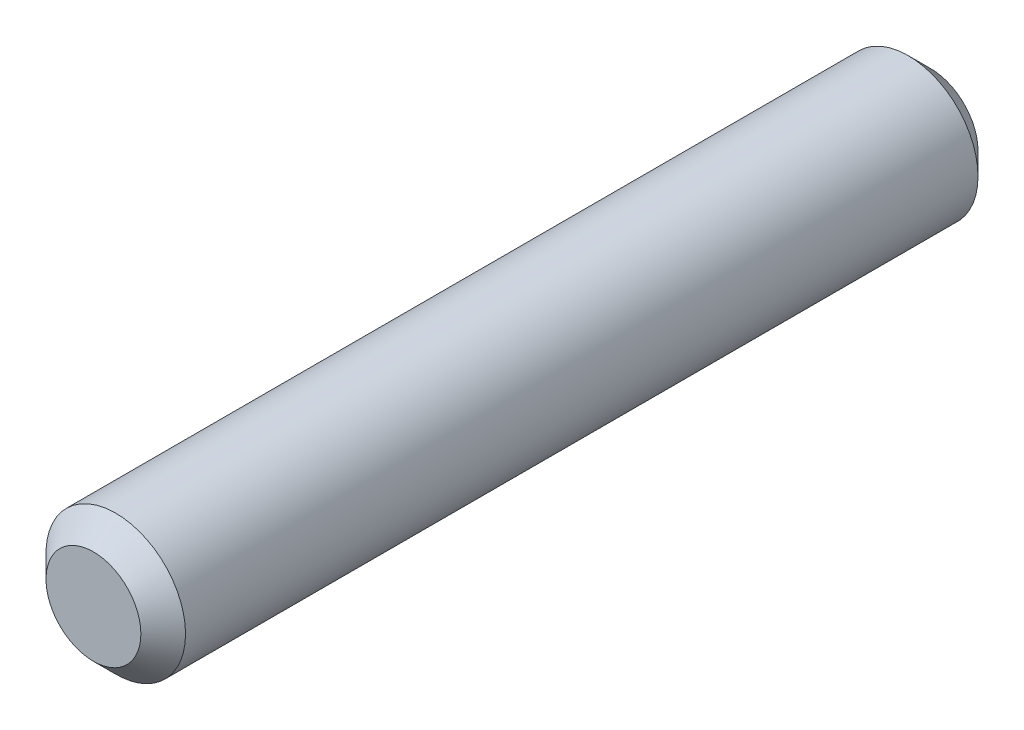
ISO-10303-21;
HEADER;
FILE_DESCRIPTION(('STEP AP214'),'2;1');
FILE_NAME('part.step','',(''),(''),'','','');
FILE_SCHEMA(('AUTOMOTIVE_DESIGN { 1 0 10303 214 1 1 1 1 }'));
ENDSEC;
DATA;
#1=APPLICATION_CONTEXT('core data for automotive mechanical design processes');
#2=APPLICATION_PROTOCOL_DEFINITION('international standard','automotive_design',2000,#1);
#3=PRODUCT_CONTEXT('',#1,'mechanical');
#4=PRODUCT('Part','Part','',(#3));
#5=PRODUCT_RELATED_PRODUCT_CATEGORY('part','',(#4));
#6=PRODUCT_DEFINITION_FORMATION('','',#4);
#7=PRODUCT_DEFINITION_CONTEXT('part definition',#1,'design');
#8=PRODUCT_DEFINITION('design','',#6,#7);
#9=PRODUCT_DEFINITION_SHAPE('','',#8);
#10=(LENGTH_UNIT() NAMED_UNIT(*) SI_UNIT(.MILLI.,.METRE.));
#11=(NAMED_UNIT(*) PLANE_ANGLE_UNIT() SI_UNIT($,.RADIAN.));
#12=(NAMED_UNIT(*) SI_UNIT($,.STERADIAN.) SOLID_ANGLE_UNIT());
#13=UNCERTAINTY_MEASURE_WITH_UNIT(LENGTH_MEASURE(1.E-05),#10,'distance_accuracy_value','');
#14=(GEOMETRIC_REPRESENTATION_CONTEXT(3) GLOBAL_UNCERTAINTY_ASSIGNED_CONTEXT((#13)) GLOBAL_UNIT_ASSIGNED_CONTEXT((#10,
#11,#12)) REPRESENTATION_CONTEXT('',''));
#15=CARTESIAN_POINT('',(0.,0.,0.));
#16=DIRECTION('',(0.,0.,1.));
#17=DIRECTION('',(1.,0.,0.));
#18=AXIS2_PLACEMENT_3D('',#15,#16,#17);
#19=CARTESIAN_POINT('',(0.,0.,-4.7625));
#20=DIRECTION('',(0.,0.,1.));
#21=DIRECTION('',(1.,0.,0.));
#22=AXIS2_PLACEMENT_3D('',#19,#20,#21);
#23=CYLINDRICAL_SURFACE('',#22,0.79375);
#24=CARTESIAN_POINT('',(0.,0.,-4.5085));
#25=DIRECTION('',(0.,0.,1.));
#26=DIRECTION('',(1.,0.,0.));
#27=AXIS2_PLACEMENT_3D('',#24,#25,#26);
#28=CIRCLE('',#27,0.79375);
#29=CARTESIAN_POINT('',(0.79375,0.,-4.5085));
#30=VERTEX_POINT('',#29);
#31=EDGE_CURVE('E50',#30,#30,#28,.T.);
#32=ORIENTED_EDGE('',*,*,#31,.T.);
#33=EDGE_LOOP('',(#32));
#34=FACE_BOUND('',#33,.T.);
#35=CARTESIAN_POINT('',(0.,0.,4.5085));
#36=DIRECTION('',(0.,0.,1.));
#37=DIRECTION('',(1.,0.,0.));
#38=AXIS2_PLACEMENT_3D('',#35,#36,#37);
#39=CIRCLE('',#38,0.79375);
#40=CARTESIAN_POINT('',(0.79375,0.,4.5085));
#41=VERTEX_POINT('',#40);
#42=EDGE_CURVE('E55',#41,#41,#39,.F.);
#43=ORIENTED_EDGE('',*,*,#42,.T.);
#44=EDGE_LOOP('',(#43));
#45=FACE_BOUND('',#44,.T.);
#46=ADVANCED_FACE('F36',(#34,#45),#23,.T.);
#47=CARTESIAN_POINT('',(0.,0.,-4.7625));
#48=DIRECTION('',(0.,0.,1.));
#49=DIRECTION('',(1.,0.,0.));
#50=AXIS2_PLACEMENT_3D('',#47,#48,#49);
#51=PLANE('',#50);
#52=CARTESIAN_POINT('',(0.,0.,-4.7625));
#53=DIRECTION('',(0.,0.,1.));
#54=DIRECTION('',(1.,0.,0.));
#55=AXIS2_PLACEMENT_3D('',#52,#53,#54);
#56=CIRCLE('',#55,0.53975);
#57=CARTESIAN_POINT('',(0.53975,0.,-4.7625));
#58=VERTEX_POINT('',#57);
#59=EDGE_CURVE('E44',#58,#58,#56,.F.);
#60=ORIENTED_EDGE('',*,*,#59,.T.);
#61=EDGE_LOOP('',(#60));
#62=FACE_BOUND('',#61,.T.);
#63=ADVANCED_FACE('F71',(#62),#51,.F.);
#64=CARTESIAN_POINT('',(0.,0.,4.7625));
#65=DIRECTION('',(0.,0.,1.));
#66=DIRECTION('',(1.,0.,0.));
#67=AXIS2_PLACEMENT_3D('',#64,#65,#66);
#68=PLANE('',#67);
#69=CARTESIAN_POINT('',(0.,0.,4.7625));
#70=DIRECTION('',(0.,0.,1.));
#71=DIRECTION('',(1.,0.,0.));
#72=AXIS2_PLACEMENT_3D('',#69,#70,#71);
#73=CIRCLE('',#72,0.539749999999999);
#74=CARTESIAN_POINT('',(0.539749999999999,0.,4.7625));
#75=VERTEX_POINT('',#74);
#76=EDGE_CURVE('E10',#75,#75,#73,.T.);
#77=ORIENTED_EDGE('',*,*,#76,.T.);
#78=EDGE_LOOP('',(#77));
#79=FACE_BOUND('',#78,.T.);
#80=ADVANCED_FACE('F68',(#79),#68,.T.);
#81=CARTESIAN_POINT('',(0.,0.,-4.5085));
#82=DIRECTION('',(0.,0.,1.));
#83=DIRECTION('',(1.,0.,0.));
#84=AXIS2_PLACEMENT_3D('',#81,#82,#83);
#85=CONICAL_SURFACE('',#84,0.79375,0.785398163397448);
#86=ORIENTED_EDGE('',*,*,#59,.F.);
#87=EDGE_LOOP('',(#86));
#88=FACE_BOUND('',#87,.T.);
#89=ORIENTED_EDGE('',*,*,#31,.F.);
#90=EDGE_LOOP('',(#89));
#91=FACE_BOUND('',#90,.T.);
#92=ADVANCED_FACE('F64',(#88,#91),#85,.T.);
#93=CARTESIAN_POINT('',(0.,0.,4.7625));
#94=DIRECTION('',(0.,0.,-1.));
#95=DIRECTION('',(-1.,0.,0.));
#96=AXIS2_PLACEMENT_3D('',#93,#94,#95);
#97=CONICAL_SURFACE('',#96,0.53975,0.78539816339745);
#98=ORIENTED_EDGE('',*,*,#42,.F.);
#99=EDGE_LOOP('',(#98));
#100=FACE_BOUND('',#99,.T.);
#101=ORIENTED_EDGE('',*,*,#76,.F.);
#102=EDGE_LOOP('',(#101));
#103=FACE_BOUND('',#102,.T.);
#104=ADVANCED_FACE('F38',(#100,#103),#97,.T.);
#105=CLOSED_SHELL('',(#46,#63,#80,#92,#104));
#106=MANIFOLD_SOLID_BREP('B2',#105);
#107=ADVANCED_BREP_SHAPE_REPRESENTATION('',(#18,#106),#14);
#108=SHAPE_DEFINITION_REPRESENTATION(#9,#107);
ENDSEC;
END-ISO-10303-21;
